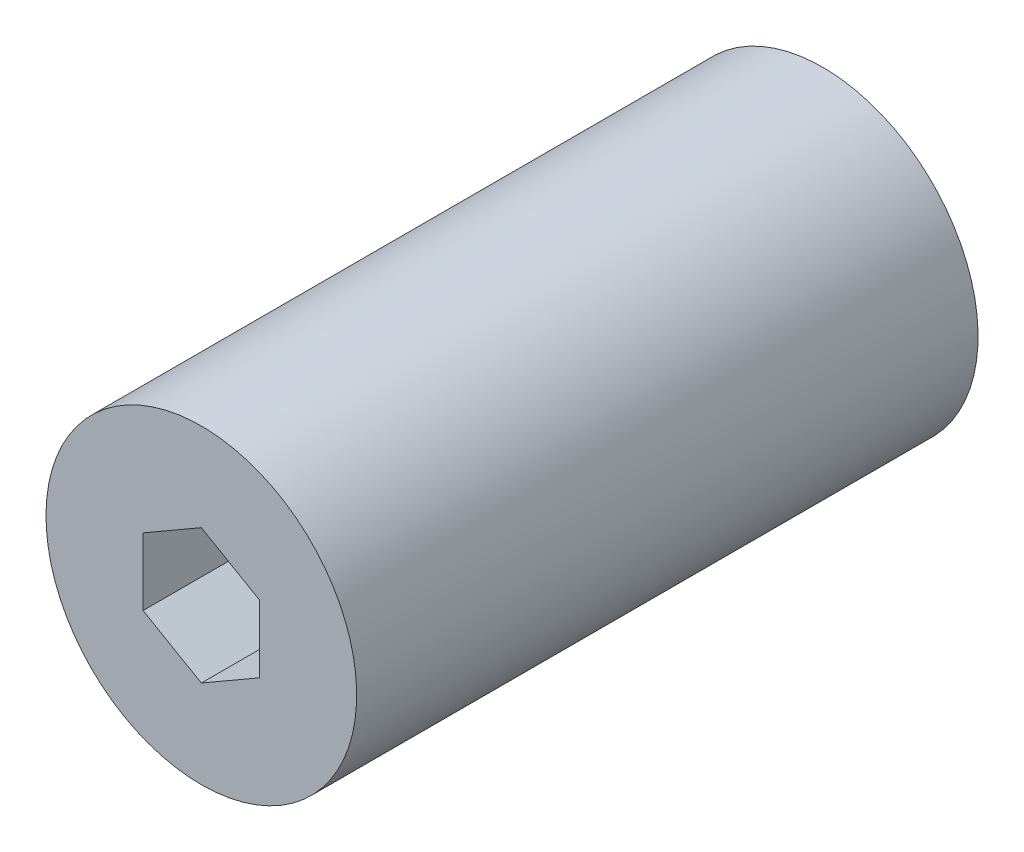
ISO-10303-21;
HEADER;
FILE_DESCRIPTION(('STEP AP214'),'2;1');
FILE_NAME('part.step','',(''),(''),'','','');
FILE_SCHEMA(('AUTOMOTIVE_DESIGN { 1 0 10303 214 1 1 1 1 }'));
ENDSEC;
DATA;
#1=APPLICATION_CONTEXT('core data for automotive mechanical design processes');
#2=APPLICATION_PROTOCOL_DEFINITION('international standard','automotive_design',2000,#1);
#3=PRODUCT_CONTEXT('',#1,'mechanical');
#4=PRODUCT('Part','Part','',(#3));
#5=PRODUCT_RELATED_PRODUCT_CATEGORY('part','',(#4));
#6=PRODUCT_DEFINITION_FORMATION('','',#4);
#7=PRODUCT_DEFINITION_CONTEXT('part definition',#1,'design');
#8=PRODUCT_DEFINITION('design','',#6,#7);
#9=PRODUCT_DEFINITION_SHAPE('','',#8);
#10=(LENGTH_UNIT() NAMED_UNIT(*) SI_UNIT(.MILLI.,.METRE.));
#11=(NAMED_UNIT(*) PLANE_ANGLE_UNIT() SI_UNIT($,.RADIAN.));
#12=(NAMED_UNIT(*) SI_UNIT($,.STERADIAN.) SOLID_ANGLE_UNIT());
#13=UNCERTAINTY_MEASURE_WITH_UNIT(LENGTH_MEASURE(1.E-05),#10,'distance_accuracy_value','');
#14=(GEOMETRIC_REPRESENTATION_CONTEXT(3) GLOBAL_UNCERTAINTY_ASSIGNED_CONTEXT((#13)) GLOBAL_UNIT_ASSIGNED_CONTEXT((#10,
#11,#12)) REPRESENTATION_CONTEXT('',''));
#15=CARTESIAN_POINT('',(0.,0.,0.));
#16=DIRECTION('',(0.,0.,1.));
#17=DIRECTION('',(1.,0.,0.));
#18=AXIS2_PLACEMENT_3D('',#15,#16,#17);
#19=CARTESIAN_POINT('',(0.,0.,32.));
#20=DIRECTION('',(0.,0.,-1.));
#21=DIRECTION('',(0.5,0.866025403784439,0.));
#22=AXIS2_PLACEMENT_3D('',#19,#20,#21);
#23=CYLINDRICAL_SURFACE('',#22,8.);
#24=CARTESIAN_POINT('',(0.,0.,32.));
#25=DIRECTION('',(0.,0.,1.));
#26=DIRECTION('',(-0.5,-0.866025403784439,0.));
#27=AXIS2_PLACEMENT_3D('',#24,#25,#26);
#28=CIRCLE('',#27,8.);
#29=CARTESIAN_POINT('',(-4.,-6.92820323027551,32.));
#30=VERTEX_POINT('',#29);
#31=EDGE_CURVE('E9',#30,#30,#28,.T.);
#32=ORIENTED_EDGE('',*,*,#31,.F.);
#33=EDGE_LOOP('',(#32));
#34=FACE_BOUND('',#33,.T.);
#35=CARTESIAN_POINT('',(0.,0.,0.));
#36=DIRECTION('',(0.,0.,1.));
#37=DIRECTION('',(-0.5,-0.866025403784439,0.));
#38=AXIS2_PLACEMENT_3D('',#35,#36,#37);
#39=CIRCLE('',#38,8.);
#40=CARTESIAN_POINT('',(-4.,-6.92820323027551,0.));
#41=VERTEX_POINT('',#40);
#42=EDGE_CURVE('E21',#41,#41,#39,.T.);
#43=ORIENTED_EDGE('',*,*,#42,.T.);
#44=EDGE_LOOP('',(#43));
#45=FACE_BOUND('',#44,.T.);
#46=ADVANCED_FACE('F14',(#34,#45),#23,.T.);
#47=CARTESIAN_POINT('',(0.,0.,32.));
#48=DIRECTION('',(0.,0.,1.));
#49=DIRECTION('',(-0.5,-0.866025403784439,0.));
#50=AXIS2_PLACEMENT_3D('',#47,#48,#49);
#51=PLANE('',#50);
#52=DIRECTION('',(0.866025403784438,0.5,0.));
#53=VECTOR('',#52,1.);
#54=CARTESIAN_POINT('',(0.,-3.46410161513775,32.));
#55=LINE('',#54,#53);
#56=CARTESIAN_POINT('',(0.,-3.46410161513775,32.));
#57=VERTEX_POINT('',#56);
#58=CARTESIAN_POINT('',(3.,-1.73205080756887,32.));
#59=VERTEX_POINT('',#58);
#60=EDGE_CURVE('E28',#57,#59,#55,.T.);
#61=ORIENTED_EDGE('',*,*,#60,.F.);
#62=DIRECTION('',(0.866025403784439,-0.5,0.));
#63=VECTOR('',#62,1.);
#64=CARTESIAN_POINT('',(-3.,-1.73205080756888,32.));
#65=LINE('',#64,#63);
#66=CARTESIAN_POINT('',(-3.,-1.73205080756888,32.));
#67=VERTEX_POINT('',#66);
#68=EDGE_CURVE('E98',#67,#57,#65,.T.);
#69=ORIENTED_EDGE('',*,*,#68,.F.);
#70=DIRECTION('',(0.,-1.,0.));
#71=VECTOR('',#70,1.);
#72=CARTESIAN_POINT('',(-3.,1.73205080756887,32.));
#73=LINE('',#72,#71);
#74=CARTESIAN_POINT('',(-3.,1.73205080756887,32.));
#75=VERTEX_POINT('',#74);
#76=EDGE_CURVE('E92',#75,#67,#73,.T.);
#77=ORIENTED_EDGE('',*,*,#76,.F.);
#78=DIRECTION('',(-0.866025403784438,-0.5,0.));
#79=VECTOR('',#78,1.);
#80=CARTESIAN_POINT('',(0.,3.46410161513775,32.));
#81=LINE('',#80,#79);
#82=CARTESIAN_POINT('',(0.,3.46410161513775,32.));
#83=VERTEX_POINT('',#82);
#84=EDGE_CURVE('E90',#83,#75,#81,.T.);
#85=ORIENTED_EDGE('',*,*,#84,.F.);
#86=DIRECTION('',(-0.866025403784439,0.5,0.));
#87=VECTOR('',#86,1.);
#88=CARTESIAN_POINT('',(3.,1.73205080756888,32.));
#89=LINE('',#88,#87);
#90=CARTESIAN_POINT('',(3.,1.73205080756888,32.));
#91=VERTEX_POINT('',#90);
#92=EDGE_CURVE('E71',#91,#83,#89,.T.);
#93=ORIENTED_EDGE('',*,*,#92,.F.);
#94=DIRECTION('',(0.,1.,0.));
#95=VECTOR('',#94,1.);
#96=CARTESIAN_POINT('',(3.,-1.73205080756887,32.));
#97=LINE('',#96,#95);
#98=EDGE_CURVE('E82',#59,#91,#97,.T.);
#99=ORIENTED_EDGE('',*,*,#98,.F.);
#100=EDGE_LOOP('',(#61,#69,#77,#85,#93,#99));
#101=FACE_BOUND('',#100,.T.);
#102=ORIENTED_EDGE('',*,*,#31,.T.);
#103=EDGE_LOOP('',(#102));
#104=FACE_BOUND('',#103,.T.);
#105=ADVANCED_FACE('F86',(#101,#104),#51,.T.);
#106=CARTESIAN_POINT('',(0.,0.,0.));
#107=DIRECTION('',(0.,0.,1.));
#108=DIRECTION('',(-0.5,-0.866025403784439,0.));
#109=AXIS2_PLACEMENT_3D('',#106,#107,#108);
#110=PLANE('',#109);
#111=ORIENTED_EDGE('',*,*,#42,.F.);
#112=EDGE_LOOP('',(#111));
#113=FACE_BOUND('',#112,.T.);
#114=ADVANCED_FACE('F125',(#113),#110,.F.);
#115=CARTESIAN_POINT('',(0.,-3.46410161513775,27.5));
#116=DIRECTION('',(0.5,-0.866025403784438,0.));
#117=DIRECTION('',(0.866025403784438,0.5,0.));
#118=AXIS2_PLACEMENT_3D('',#115,#116,#117);
#119=PLANE('',#118);
#120=ORIENTED_EDGE('',*,*,#60,.T.);
#121=DIRECTION('',(0.,0.,1.));
#122=VECTOR('',#121,1.);
#123=CARTESIAN_POINT('',(3.,-1.73205080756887,27.5));
#124=LINE('',#123,#122);
#125=CARTESIAN_POINT('',(3.,-1.73205080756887,27.5));
#126=VERTEX_POINT('',#125);
#127=EDGE_CURVE('E79',#126,#59,#124,.T.);
#128=ORIENTED_EDGE('',*,*,#127,.F.);
#129=DIRECTION('',(0.866025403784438,0.5,0.));
#130=VECTOR('',#129,1.);
#131=CARTESIAN_POINT('',(0.,-3.46410161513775,27.5));
#132=LINE('',#131,#130);
#133=CARTESIAN_POINT('',(0.,-3.46410161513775,27.5));
#134=VERTEX_POINT('',#133);
#135=EDGE_CURVE('E100',#134,#126,#132,.T.);
#136=ORIENTED_EDGE('',*,*,#135,.F.);
#137=DIRECTION('',(0.,0.,1.));
#138=VECTOR('',#137,1.);
#139=CARTESIAN_POINT('',(0.,-3.46410161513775,27.5));
#140=LINE('',#139,#138);
#141=EDGE_CURVE('E35',#134,#57,#140,.T.);
#142=ORIENTED_EDGE('',*,*,#141,.T.);
#143=EDGE_LOOP('',(#120,#128,#136,#142));
#144=FACE_BOUND('',#143,.T.);
#145=ADVANCED_FACE('F127',(#144),#119,.F.);
#146=CARTESIAN_POINT('',(-3.,-1.73205080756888,27.5));
#147=DIRECTION('',(-0.5,-0.866025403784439,0.));
#148=DIRECTION('',(0.866025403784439,-0.5,0.));
#149=AXIS2_PLACEMENT_3D('',#146,#147,#148);
#150=PLANE('',#149);
#151=ORIENTED_EDGE('',*,*,#68,.T.);
#152=ORIENTED_EDGE('',*,*,#141,.F.);
#153=DIRECTION('',(0.866025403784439,-0.5,0.));
#154=VECTOR('',#153,1.);
#155=CARTESIAN_POINT('',(-3.,-1.73205080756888,27.5));
#156=LINE('',#155,#154);
#157=CARTESIAN_POINT('',(-3.,-1.73205080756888,27.5));
#158=VERTEX_POINT('',#157);
#159=EDGE_CURVE('E112',#158,#134,#156,.T.);
#160=ORIENTED_EDGE('',*,*,#159,.F.);
#161=DIRECTION('',(0.,0.,1.));
#162=VECTOR('',#161,1.);
#163=CARTESIAN_POINT('',(-3.,-1.73205080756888,27.5));
#164=LINE('',#163,#162);
#165=EDGE_CURVE('E116',#158,#67,#164,.T.);
#166=ORIENTED_EDGE('',*,*,#165,.T.);
#167=EDGE_LOOP('',(#151,#152,#160,#166));
#168=FACE_BOUND('',#167,.T.);
#169=ADVANCED_FACE('F135',(#168),#150,.F.);
#170=CARTESIAN_POINT('',(-3.,1.73205080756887,27.5));
#171=DIRECTION('',(-1.,0.,0.));
#172=DIRECTION('',(0.,-1.,0.));
#173=AXIS2_PLACEMENT_3D('',#170,#171,#172);
#174=PLANE('',#173);
#175=ORIENTED_EDGE('',*,*,#76,.T.);
#176=ORIENTED_EDGE('',*,*,#165,.F.);
#177=DIRECTION('',(0.,-1.,0.));
#178=VECTOR('',#177,1.);
#179=CARTESIAN_POINT('',(-3.,1.73205080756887,27.5));
#180=LINE('',#179,#178);
#181=CARTESIAN_POINT('',(-3.,1.73205080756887,27.5));
#182=VERTEX_POINT('',#181);
#183=EDGE_CURVE('E109',#182,#158,#180,.T.);
#184=ORIENTED_EDGE('',*,*,#183,.F.);
#185=DIRECTION('',(0.,0.,1.));
#186=VECTOR('',#185,1.);
#187=CARTESIAN_POINT('',(-3.,1.73205080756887,27.5));
#188=LINE('',#187,#186);
#189=EDGE_CURVE('E118',#182,#75,#188,.T.);
#190=ORIENTED_EDGE('',*,*,#189,.T.);
#191=EDGE_LOOP('',(#175,#176,#184,#190));
#192=FACE_BOUND('',#191,.T.);
#193=ADVANCED_FACE('F173',(#192),#174,.F.);
#194=CARTESIAN_POINT('',(0.,3.46410161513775,27.5));
#195=DIRECTION('',(-0.5,0.866025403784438,0.));
#196=DIRECTION('',(-0.866025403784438,-0.5,0.));
#197=AXIS2_PLACEMENT_3D('',#194,#195,#196);
#198=PLANE('',#197);
#199=ORIENTED_EDGE('',*,*,#84,.T.);
#200=ORIENTED_EDGE('',*,*,#189,.F.);
#201=DIRECTION('',(-0.866025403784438,-0.5,0.));
#202=VECTOR('',#201,1.);
#203=CARTESIAN_POINT('',(0.,3.46410161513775,27.5));
#204=LINE('',#203,#202);
#205=CARTESIAN_POINT('',(0.,3.46410161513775,27.5));
#206=VERTEX_POINT('',#205);
#207=EDGE_CURVE('E106',#206,#182,#204,.T.);
#208=ORIENTED_EDGE('',*,*,#207,.F.);
#209=DIRECTION('',(0.,0.,1.));
#210=VECTOR('',#209,1.);
#211=CARTESIAN_POINT('',(0.,3.46410161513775,27.5));
#212=LINE('',#211,#210);
#213=EDGE_CURVE('E78',#206,#83,#212,.T.);
#214=ORIENTED_EDGE('',*,*,#213,.T.);
#215=EDGE_LOOP('',(#199,#200,#208,#214));
#216=FACE_BOUND('',#215,.T.);
#217=ADVANCED_FACE('F180',(#216),#198,.F.);
#218=CARTESIAN_POINT('',(3.,1.73205080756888,27.5));
#219=DIRECTION('',(0.5,0.866025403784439,0.));
#220=DIRECTION('',(-0.866025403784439,0.5,0.));
#221=AXIS2_PLACEMENT_3D('',#218,#219,#220);
#222=PLANE('',#221);
#223=ORIENTED_EDGE('',*,*,#92,.T.);
#224=ORIENTED_EDGE('',*,*,#213,.F.);
#225=DIRECTION('',(-0.866025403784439,0.5,0.));
#226=VECTOR('',#225,1.);
#227=CARTESIAN_POINT('',(3.,1.73205080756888,27.5));
#228=LINE('',#227,#226);
#229=CARTESIAN_POINT('',(3.,1.73205080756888,27.5));
#230=VERTEX_POINT('',#229);
#231=EDGE_CURVE('E74',#230,#206,#228,.T.);
#232=ORIENTED_EDGE('',*,*,#231,.F.);
#233=DIRECTION('',(0.,0.,1.));
#234=VECTOR('',#233,1.);
#235=CARTESIAN_POINT('',(3.,1.73205080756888,27.5));
#236=LINE('',#235,#234);
#237=EDGE_CURVE('E67',#230,#91,#236,.T.);
#238=ORIENTED_EDGE('',*,*,#237,.T.);
#239=EDGE_LOOP('',(#223,#224,#232,#238));
#240=FACE_BOUND('',#239,.T.);
#241=ADVANCED_FACE('F69',(#240),#222,.F.);
#242=CARTESIAN_POINT('',(3.,-1.73205080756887,27.5));
#243=DIRECTION('',(1.,0.,0.));
#244=DIRECTION('',(0.,1.,0.));
#245=AXIS2_PLACEMENT_3D('',#242,#243,#244);
#246=PLANE('',#245);
#247=ORIENTED_EDGE('',*,*,#98,.T.);
#248=ORIENTED_EDGE('',*,*,#237,.F.);
#249=DIRECTION('',(0.,1.,0.));
#250=VECTOR('',#249,1.);
#251=CARTESIAN_POINT('',(3.,-1.73205080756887,27.5));
#252=LINE('',#251,#250);
#253=EDGE_CURVE('E103',#126,#230,#252,.T.);
#254=ORIENTED_EDGE('',*,*,#253,.F.);
#255=ORIENTED_EDGE('',*,*,#127,.T.);
#256=EDGE_LOOP('',(#247,#248,#254,#255));
#257=FACE_BOUND('',#256,.T.);
#258=ADVANCED_FACE('F83',(#257),#246,.F.);
#259=CARTESIAN_POINT('',(3.,-1.73205080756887,27.5));
#260=DIRECTION('',(0.,0.,1.));
#261=DIRECTION('',(-0.5,-0.866025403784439,0.));
#262=AXIS2_PLACEMENT_3D('',#259,#260,#261);
#263=PLANE('',#262);
#264=ORIENTED_EDGE('',*,*,#135,.T.);
#265=ORIENTED_EDGE('',*,*,#253,.T.);
#266=ORIENTED_EDGE('',*,*,#231,.T.);
#267=ORIENTED_EDGE('',*,*,#207,.T.);
#268=ORIENTED_EDGE('',*,*,#183,.T.);
#269=ORIENTED_EDGE('',*,*,#159,.T.);
#270=EDGE_LOOP('',(#264,#265,#266,#267,#268,#269));
#271=FACE_BOUND('',#270,.T.);
#272=ADVANCED_FACE('F204',(#271),#263,.T.);
#273=CLOSED_SHELL('',(#46,#105,#114,#145,#169,#193,#217,#241,#258,#272));
#274=MANIFOLD_SOLID_BREP('B1',#273);
#275=ADVANCED_BREP_SHAPE_REPRESENTATION('',(#18,#274),#14);
#276=SHAPE_DEFINITION_REPRESENTATION(#9,#275);
ENDSEC;
END-ISO-10303-21;
